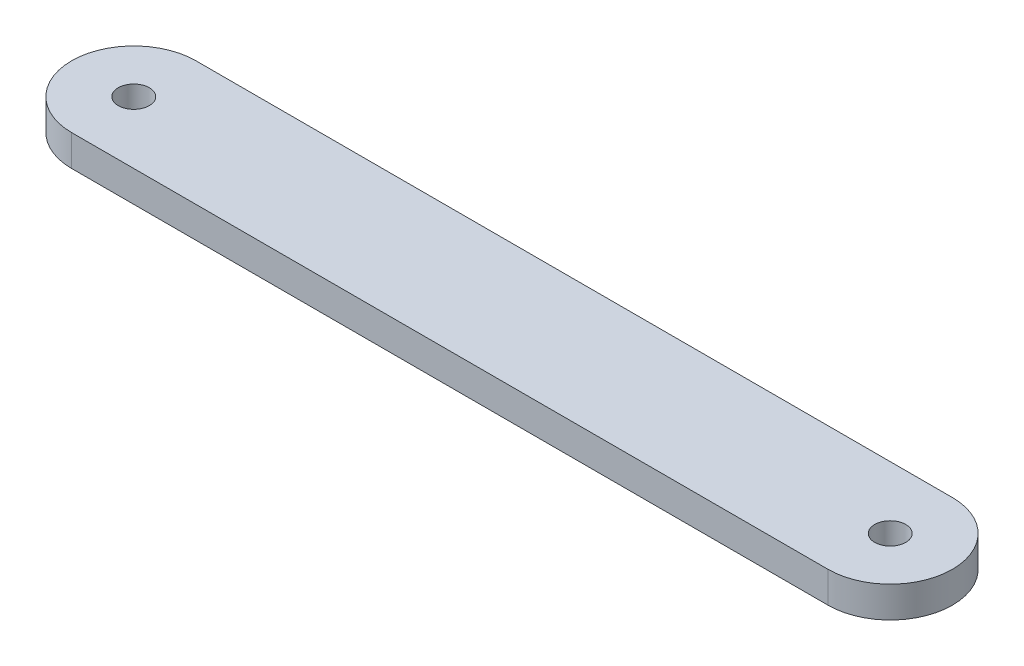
from build123d import *

# Parameters (mm, degrees)
SKETCH1_R           = 12.7
SKETCH1_R_2         = 3.175
BOSS_EXTRUDE1_DEPTH = 6.35


with BuildPart() as part:
    # Sketch1 → Boss-Extrude1 (new body)
    # profile 1 of 3: a face of its own
    with BuildSketch(Plane(origin=(0, 0, 0), x_dir=(1, 0, 0), z_dir=(0, 1, 0))):
        Circle(SKETCH1_R)
        with Locations(Location((0, 0, 0), (0, 0, 270))):
            Circle(SKETCH1_R_2, mode=Mode.SUBTRACT)
    # profile 2 of 3: a face of its own
    with BuildSketch(Plane(origin=(0, 0, 0), x_dir=(1, 0, 0), z_dir=(0, 1, 0))):
        with BuildLine():
            Line((154.5082, 12.7), (0, 12.7))
            ThreePointArc((0, 12.7), (8.980256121, 8.980256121), (12.7, 0))
            ThreePointArc((12.7, 0), (8.980256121, -8.980256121), (0, -12.7))
            Line((0, -12.7), (154.5082, -12.7))
            ThreePointArc((154.5082, -12.7), (141.8082, 0), (154.5082, 12.7))
        make_face()
    # profile 3 of 3: a face of its own
    with BuildSketch(Plane(origin=(0, 0, 0), x_dir=(1, 0, 0), z_dir=(0, 1, 0))):
        with Locations((154.5082, 0)):
            Circle(SKETCH1_R)
        with Locations(Location((154.5082, 0, 0), (0, 0, 270))):
            Circle(SKETCH1_R_2, mode=Mode.SUBTRACT)
    extrude(amount=BOSS_EXTRUDE1_DEPTH)


solid = part.part
